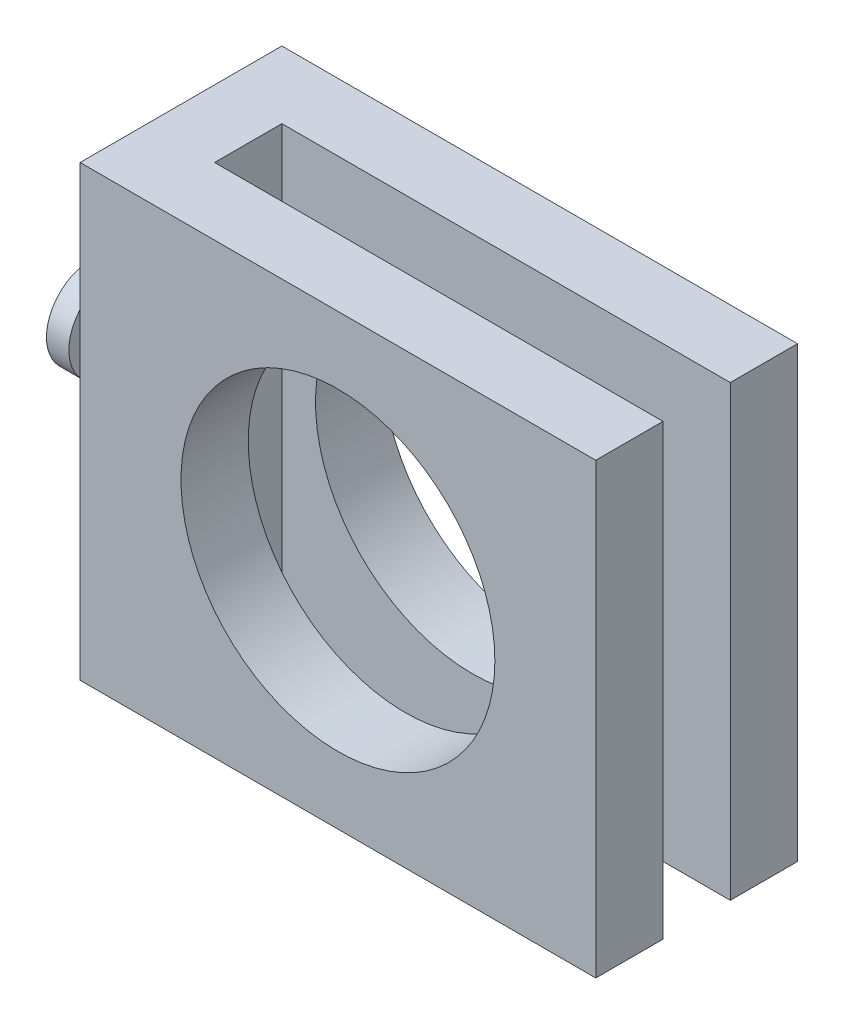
from build123d import *

# Parameters (mm, degrees)
SKETCH1_W           = 20
SKETCH1_H           = 20
BOSS_EXTRUDE1_DEPTH = 3
SKETCH2_W           = 3
SKETCH2_H           = 20
BOSS_EXTRUDE2_DEPTH = 20
SKETCH3_W           = 9
SKETCH3_H           = 20
BOSS_EXTRUDE3_DEPTH = 3
SKETCH4_R           = 1.5
BOSS_EXTRUDE4_DEPTH = 3
SKETCH5_R           = 2
BOSS_EXTRUDE5_DEPTH = 1
SKETCH6_R           = 7
CUT_EXTRUDE1_DEPTH  = 10


with BuildPart() as part:
    # Sketch1 → Boss-Extrude1 (new body)
    with BuildSketch(Plane.XY):
        Rectangle(SKETCH1_W, SKETCH1_H)
    extrude(amount=BOSS_EXTRUDE1_DEPTH)



with BuildPart() as body_2:
    # Sketch2 → Boss-Extrude2 (new body)
    with BuildSketch(Plane(origin=(10, 0, 0), x_dir=(0, 0, -1), z_dir=(1, 0, 0))):
        with Locations((4.5, 0)):
            Rectangle(SKETCH2_W, SKETCH2_H)
    extrude(amount=-BOSS_EXTRUDE2_DEPTH)


with BuildPart() as part_1:
    add(part.part)

    add(body_2.part)  # Boss-Extrude3 merges body 2
    # Sketch3 → Boss-Extrude3 (add)
    with BuildSketch(Plane.ZY.offset(10)):
        with Locations((-1.5, 0)):
            Rectangle(SKETCH3_W, SKETCH3_H)
    extrude(amount=BOSS_EXTRUDE3_DEPTH)

    # Sketch4 → Boss-Extrude4 (add)
    with BuildSketch(Plane.ZY.offset(13)):
        with Locations((-1.5, 0)):
            Circle(SKETCH4_R)
    extrude(amount=BOSS_EXTRUDE4_DEPTH)

    # Sketch5 → Boss-Extrude5 (add)
    with BuildSketch(Plane.ZY.offset(16)):
        with Locations((-1.5, 0)):
            Circle(SKETCH5_R)
    extrude(amount=BOSS_EXTRUDE5_DEPTH)

    # Sketch6 → Cut-Extrude1 (cut)
    with BuildSketch(Plane.XY.offset(3)):
        with Locations((-1.5, 0)):
            Circle(SKETCH6_R)
    extrude(amount=-CUT_EXTRUDE1_DEPTH, mode=Mode.SUBTRACT)


solid = part_1.part
